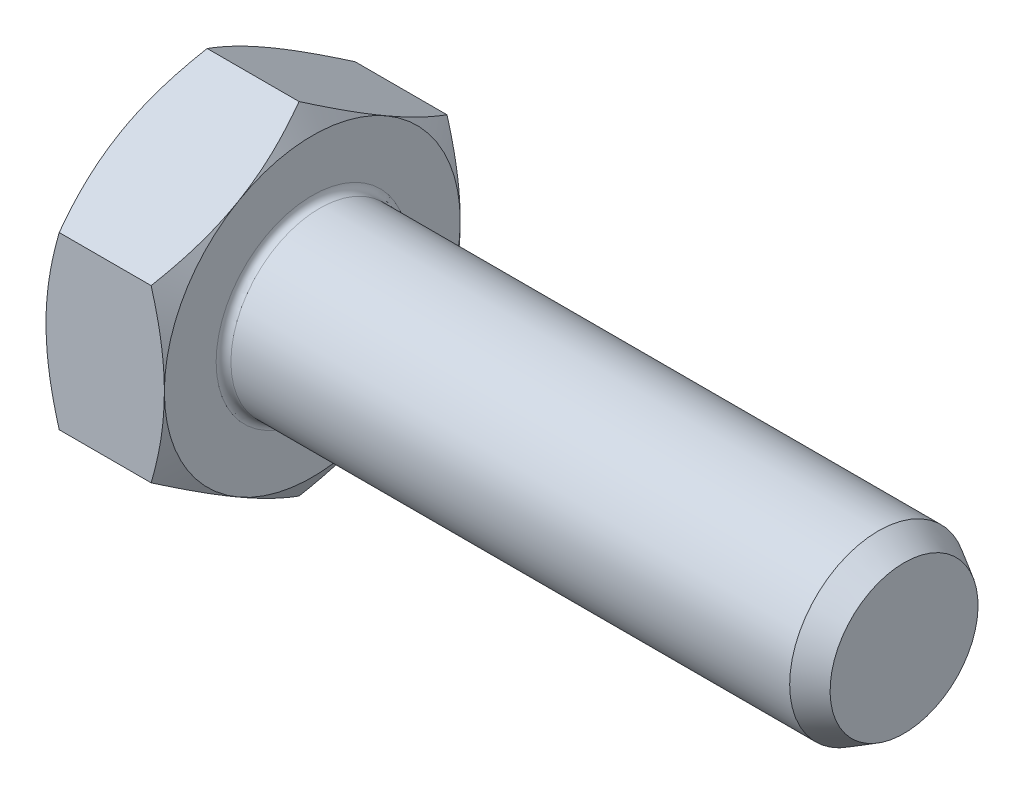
from build123d import *

# Parameters (mm, degrees)
BASEHEAD_DEPTH = 4
SKETCH1_W      = 20
SKETCH1_H      = 3
FILLET2_R      = 0.25
SKETCH6_W      = 0.8
SKETCH6_H      = 4.166666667


with BuildPart() as part:
    # Sketch2 → BaseHead (new body)
    with BuildSketch(Plane(origin=(0, 0, 0), x_dir=(0, 0, -1), z_dir=(1, 0, 0))):
        Polygon((0, 5.773502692), (-5, 2.886751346), (-5, -2.886751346), (0, -5.773502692), (5, -2.886751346), (5, 2.886751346), align=None)
    extrude(amount=BASEHEAD_DEPTH)

    # Sketch1 → BaseBody (revolve)
    with BuildSketch(Plane.XY, mode=Mode.PRIVATE) as basebody_sk:
        with Locations((14, 1.5)):
            Rectangle(SKETCH1_W, SKETCH1_H)
    revolve(basebody_sk.sketch.rotate(Axis((-14.105406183, 0, 0), (1, 0, 0)), 90), axis=Axis((-14.105406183, 0, 0), (1, 0, 0)))

    # Fillet2
    fillet2_edges = [part.edges().sort_by_distance(p)[0] for p in [
        (4, 0, -3),
    ]]
    fillet(fillet2_edges, radius=FILLET2_R)

    # Sketch3 → Cut-Revolve3 (revolve, cut)
    with BuildSketch(Plane.XY):
        Polygon((0, 5.773502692), (0.446581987, 5.773502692), (0, 5), align=None)
        Polygon((4, 5), (4, 5.773502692), (3.553418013, 5.773502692), align=None)
    revolve(axis=Axis((4.411893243, 0, 0), (1, 0, 0)), mode=Mode.SUBTRACT)

    # Sketch4 → Cut-Revolve1 (revolve, cut)
    with BuildSketch(Plane.XY, mode=Mode.PRIVATE) as cut_revolve1_sk:
        Polygon((23.133974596, -3), (24, -2.5), (24, -3), align=None)
    revolve(cut_revolve1_sk.sketch.rotate(Axis((25.328193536, 0, 0), (-1, 0, 0)), 90), axis=Axis((25.328193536, 0, 0), (-1, 0, 0)), mode=Mode.SUBTRACT)

    # Sketch6 → Cut-Revolve4 (revolve, cut)
    with BuildSketch(Plane.XY):
        with Locations((0.4, 2.083333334)):
            Rectangle(SKETCH6_W, SKETCH6_H)
    revolve(axis=Axis((0, 0, 0), (1, 0, 0)), mode=Mode.SUBTRACT)


solid = part.part
